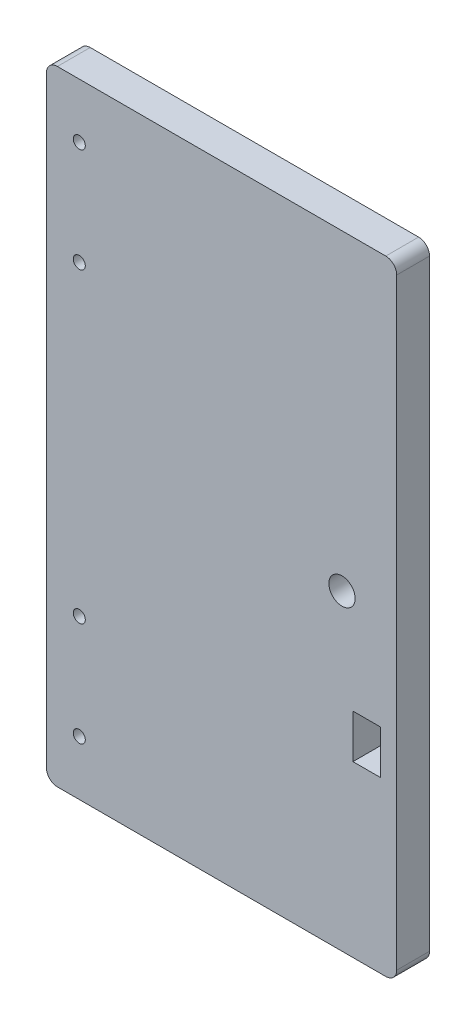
from build123d import *

# Parameters (mm, degrees)
EXTRUSION1_DEPTH        = 6
ESQUISSE2_R             = 2.4
ESQUISSE2_R_2           = 1.1
ESQUISSE2_W             = 5
ESQUISSE2_H             = 8
ENL_V_MAT_EXTRU_1_DEPTH = 131.873985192


with BuildPart() as part:
    # Esquisse1 → Extrusion1 (new body)
    with BuildSketch(Plane.XY):
        with BuildLine():
            Line((2, 0), (62, 0))
            ThreePointArc((62, 0), (63.414213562, 0.585786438), (64, 2))
            Line((64, 2), (64, 112))
            ThreePointArc((64, 112), (63.414213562, 113.414213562), (62, 114))
            Line((62, 114), (2, 114))
            ThreePointArc((2, 114), (0.585786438, 113.414213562), (0, 112))
            Line((0, 112), (0, 2))
            ThreePointArc((0, 2), (0.585786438, 0.585786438), (2, 0))
        make_face()
    extrude(amount=EXTRUSION1_DEPTH)

    # Esquisse2 → Enl_v. mat.-Extru.1 (cut, through all)
    with BuildSketch(Plane.XY.offset(6)):
        with Locations((54, 57)):
            Circle(ESQUISSE2_R)
        with Locations((6, 104)):
            Circle(ESQUISSE2_R_2)
        with Locations((6, 85)):
            Circle(ESQUISSE2_R_2)
        with Locations((6, 29)):
            Circle(ESQUISSE2_R_2)
        with Locations((6, 10)):
            Circle(ESQUISSE2_R_2)
        with Locations((58.5, 35)):
            Rectangle(ESQUISSE2_W, ESQUISSE2_H)
    extrude(amount=-ENL_V_MAT_EXTRU_1_DEPTH, mode=Mode.SUBTRACT)


solid = part.part
